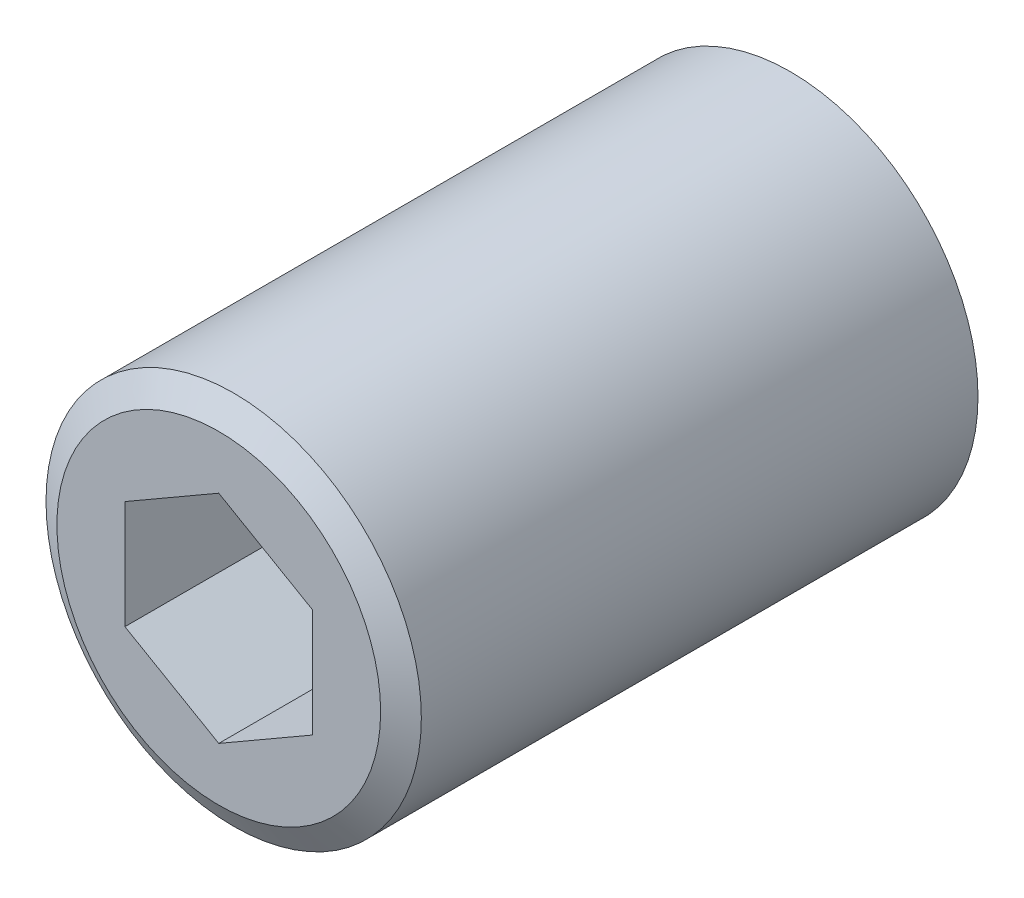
ISO-10303-21;
HEADER;
FILE_DESCRIPTION(('STEP AP214'),'2;1');
FILE_NAME('part.step','',(''),(''),'','','');
FILE_SCHEMA(('AUTOMOTIVE_DESIGN { 1 0 10303 214 1 1 1 1 }'));
ENDSEC;
DATA;
#1=APPLICATION_CONTEXT('core data for automotive mechanical design processes');
#2=APPLICATION_PROTOCOL_DEFINITION('international standard','automotive_design',2000,#1);
#3=PRODUCT_CONTEXT('',#1,'mechanical');
#4=PRODUCT('Part','Part','',(#3));
#5=PRODUCT_RELATED_PRODUCT_CATEGORY('part','',(#4));
#6=PRODUCT_DEFINITION_FORMATION('','',#4);
#7=PRODUCT_DEFINITION_CONTEXT('part definition',#1,'design');
#8=PRODUCT_DEFINITION('design','',#6,#7);
#9=PRODUCT_DEFINITION_SHAPE('','',#8);
#10=(LENGTH_UNIT() NAMED_UNIT(*) SI_UNIT(.MILLI.,.METRE.));
#11=(NAMED_UNIT(*) PLANE_ANGLE_UNIT() SI_UNIT($,.RADIAN.));
#12=(NAMED_UNIT(*) SI_UNIT($,.STERADIAN.) SOLID_ANGLE_UNIT());
#13=UNCERTAINTY_MEASURE_WITH_UNIT(LENGTH_MEASURE(1.E-05),#10,'distance_accuracy_value','');
#14=(GEOMETRIC_REPRESENTATION_CONTEXT(3) GLOBAL_UNCERTAINTY_ASSIGNED_CONTEXT((#13)) GLOBAL_UNIT_ASSIGNED_CONTEXT((#10,
#11,#12)) REPRESENTATION_CONTEXT('',''));
#15=CARTESIAN_POINT('',(0.,0.,0.));
#16=DIRECTION('',(0.,0.,1.));
#17=DIRECTION('',(1.,0.,0.));
#18=AXIS2_PLACEMENT_3D('',#15,#16,#17);
#19=CARTESIAN_POINT('',(8.,0.,1.27));
#20=DIRECTION('',(0.,0.,-1.));
#21=DIRECTION('',(-1.,0.,0.));
#22=AXIS2_PLACEMENT_3D('',#19,#20,#21);
#23=PLANE('',#22);
#24=CARTESIAN_POINT('',(0.,0.,1.27));
#25=DIRECTION('',(0.,0.,-1.));
#26=DIRECTION('',(-1.,0.,0.));
#27=AXIS2_PLACEMENT_3D('',#24,#25,#26);
#28=CIRCLE('',#27,6.9);
#29=CARTESIAN_POINT('',(-6.9,0.,1.27));
#30=VERTEX_POINT('',#29);
#31=EDGE_CURVE('E9',#30,#30,#28,.T.);
#32=ORIENTED_EDGE('',*,*,#31,.T.);
#33=EDGE_LOOP('',(#32));
#34=FACE_BOUND('',#33,.T.);
#35=CARTESIAN_POINT('',(0.,0.,1.27));
#36=DIRECTION('',(0.,0.,-1.));
#37=DIRECTION('',(-1.,0.,0.));
#38=AXIS2_PLACEMENT_3D('',#35,#36,#37);
#39=CIRCLE('',#38,5.55);
#40=CARTESIAN_POINT('',(-5.55,0.,1.27));
#41=VERTEX_POINT('',#40);
#42=EDGE_CURVE('E305',#41,#41,#39,.T.);
#43=ORIENTED_EDGE('',*,*,#42,.F.);
#44=EDGE_LOOP('',(#43));
#45=FACE_BOUND('',#44,.T.);
#46=ADVANCED_FACE('F15',(#34,#45),#23,.T.);
#47=CARTESIAN_POINT('',(0.,0.,46.27));
#48=DIRECTION('',(0.,0.,1.));
#49=DIRECTION('',(1.,0.,0.));
#50=AXIS2_PLACEMENT_3D('',#47,#48,#49);
#51=CYLINDRICAL_SURFACE('',#50,8.);
#52=CARTESIAN_POINT('',(0.,0.,25.6349147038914));
#53=DIRECTION('',(0.,0.,1.));
#54=DIRECTION('',(1.,0.,0.));
#55=AXIS2_PLACEMENT_3D('',#52,#53,#54);
#56=CIRCLE('',#55,8.);
#57=CARTESIAN_POINT('',(8.,0.,25.6349147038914));
#58=VERTEX_POINT('',#57);
#59=EDGE_CURVE('E24',#58,#58,#56,.F.);
#60=ORIENTED_EDGE('',*,*,#59,.T.);
#61=EDGE_LOOP('',(#60));
#62=FACE_BOUND('',#61,.T.);
#63=CARTESIAN_POINT('',(0.,0.,1.9050852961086));
#64=DIRECTION('',(0.,0.,-1.));
#65=DIRECTION('',(-1.,0.,0.));
#66=AXIS2_PLACEMENT_3D('',#63,#64,#65);
#67=CIRCLE('',#66,8.);
#68=CARTESIAN_POINT('',(-8.,0.,1.9050852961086));
#69=VERTEX_POINT('',#68);
#70=EDGE_CURVE('E240',#69,#69,#67,.F.);
#71=ORIENTED_EDGE('',*,*,#70,.T.);
#72=EDGE_LOOP('',(#71));
#73=FACE_BOUND('',#72,.T.);
#74=ADVANCED_FACE('F247',(#62,#73),#51,.T.);
#75=CARTESIAN_POINT('',(0.,0.,26.27));
#76=DIRECTION('',(0.,0.,1.));
#77=DIRECTION('',(1.,0.,0.));
#78=AXIS2_PLACEMENT_3D('',#75,#76,#77);
#79=PLANE('',#78);
#80=CARTESIAN_POINT('',(0.,0.,26.27));
#81=DIRECTION('',(0.,0.,1.));
#82=DIRECTION('',(1.,0.,0.));
#83=AXIS2_PLACEMENT_3D('',#80,#81,#82);
#84=CIRCLE('',#83,6.9);
#85=CARTESIAN_POINT('',(6.9,0.,26.27));
#86=VERTEX_POINT('',#85);
#87=EDGE_CURVE('E236',#86,#86,#84,.T.);
#88=ORIENTED_EDGE('',*,*,#87,.T.);
#89=EDGE_LOOP('',(#88));
#90=FACE_BOUND('',#89,.T.);
#91=DIRECTION('',(0.86602540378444,-0.5,0.));
#92=VECTOR('',#91,1.);
#93=CARTESIAN_POINT('',(-4.,-2.30940107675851,26.27));
#94=LINE('',#93,#92);
#95=CARTESIAN_POINT('',(-4.,-2.30940107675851,26.27));
#96=VERTEX_POINT('',#95);
#97=CARTESIAN_POINT('',(0.,-4.618802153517,26.27));
#98=VERTEX_POINT('',#97);
#99=EDGE_CURVE('E153',#96,#98,#94,.T.);
#100=ORIENTED_EDGE('',*,*,#99,.F.);
#101=DIRECTION('',(0.,-1.,0.));
#102=VECTOR('',#101,1.);
#103=CARTESIAN_POINT('',(-4.,2.30940107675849,26.27));
#104=LINE('',#103,#102);
#105=CARTESIAN_POINT('',(-4.,2.30940107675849,26.27));
#106=VERTEX_POINT('',#105);
#107=EDGE_CURVE('E173',#106,#96,#104,.T.);
#108=ORIENTED_EDGE('',*,*,#107,.F.);
#109=DIRECTION('',(0.866025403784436,0.5,0.));
#110=VECTOR('',#109,1.);
#111=CARTESIAN_POINT('',(-4.,2.30940107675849,26.27));
#112=LINE('',#111,#110);
#113=CARTESIAN_POINT('',(0.,4.61880215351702,26.27));
#114=VERTEX_POINT('',#113);
#115=EDGE_CURVE('E169',#106,#114,#112,.T.);
#116=ORIENTED_EDGE('',*,*,#115,.T.);
#117=DIRECTION('',(-0.866025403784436,0.5,0.));
#118=VECTOR('',#117,1.);
#119=CARTESIAN_POINT('',(4.,2.30940107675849,26.27));
#120=LINE('',#119,#118);
#121=CARTESIAN_POINT('',(4.,2.30940107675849,26.27));
#122=VERTEX_POINT('',#121);
#123=EDGE_CURVE('E165',#122,#114,#120,.T.);
#124=ORIENTED_EDGE('',*,*,#123,.F.);
#125=DIRECTION('',(0.,-1.,0.));
#126=VECTOR('',#125,1.);
#127=CARTESIAN_POINT('',(4.,2.30940107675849,26.27));
#128=LINE('',#127,#126);
#129=CARTESIAN_POINT('',(4.,-2.30940107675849,26.27));
#130=VERTEX_POINT('',#129);
#131=EDGE_CURVE('E161',#122,#130,#128,.T.);
#132=ORIENTED_EDGE('',*,*,#131,.T.);
#133=DIRECTION('',(-0.866025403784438,-0.5,0.));
#134=VECTOR('',#133,1.);
#135=CARTESIAN_POINT('',(4.,-2.30940107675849,26.27));
#136=LINE('',#135,#134);
#137=EDGE_CURVE('E156',#130,#98,#136,.T.);
#138=ORIENTED_EDGE('',*,*,#137,.T.);
#139=EDGE_LOOP('',(#100,#108,#116,#124,#132,#138));
#140=FACE_BOUND('',#139,.T.);
#141=ADVANCED_FACE('F255',(#90,#140),#79,.T.);
#142=CARTESIAN_POINT('',(-4.,-2.30940107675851,20.27));
#143=DIRECTION('',(-0.5,-0.86602540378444,0.));
#144=DIRECTION('',(-0.86602540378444,0.5,0.));
#145=AXIS2_PLACEMENT_3D('',#142,#143,#144);
#146=PLANE('',#145);
#147=DIRECTION('',(0.,0.,1.));
#148=VECTOR('',#147,1.);
#149=CARTESIAN_POINT('',(-4.,-2.30940107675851,20.27));
#150=LINE('',#149,#148);
#151=CARTESIAN_POINT('',(-4.,-2.30940107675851,20.27));
#152=VERTEX_POINT('',#151);
#153=EDGE_CURVE('E217',#152,#96,#150,.T.);
#154=ORIENTED_EDGE('',*,*,#153,.T.);
#155=ORIENTED_EDGE('',*,*,#99,.T.);
#156=DIRECTION('',(0.,0.,1.));
#157=VECTOR('',#156,1.);
#158=CARTESIAN_POINT('',(0.,-4.618802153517,20.27));
#159=LINE('',#158,#157);
#160=CARTESIAN_POINT('',(0.,-4.618802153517,20.27));
#161=VERTEX_POINT('',#160);
#162=EDGE_CURVE('E201',#161,#98,#159,.T.);
#163=ORIENTED_EDGE('',*,*,#162,.F.);
#164=DIRECTION('',(0.86602540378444,-0.5,0.));
#165=VECTOR('',#164,1.);
#166=CARTESIAN_POINT('',(-4.,-2.30940107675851,20.27));
#167=LINE('',#166,#165);
#168=EDGE_CURVE('E177',#152,#161,#167,.T.);
#169=ORIENTED_EDGE('',*,*,#168,.F.);
#170=EDGE_LOOP('',(#154,#155,#163,#169));
#171=FACE_BOUND('',#170,.T.);
#172=ADVANCED_FACE('F258',(#171),#146,.F.);
#173=CARTESIAN_POINT('',(-4.,2.30940107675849,20.27));
#174=DIRECTION('',(-1.,0.,0.));
#175=DIRECTION('',(0.,0.,1.));
#176=AXIS2_PLACEMENT_3D('',#173,#174,#175);
#177=PLANE('',#176);
#178=DIRECTION('',(0.,0.,1.));
#179=VECTOR('',#178,1.);
#180=CARTESIAN_POINT('',(-4.,2.30940107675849,20.27));
#181=LINE('',#180,#179);
#182=CARTESIAN_POINT('',(-4.,2.30940107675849,20.27));
#183=VERTEX_POINT('',#182);
#184=EDGE_CURVE('E214',#183,#106,#181,.T.);
#185=ORIENTED_EDGE('',*,*,#184,.T.);
#186=ORIENTED_EDGE('',*,*,#107,.T.);
#187=ORIENTED_EDGE('',*,*,#153,.F.);
#188=DIRECTION('',(0.,-1.,0.));
#189=VECTOR('',#188,1.);
#190=CARTESIAN_POINT('',(-4.,2.30940107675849,20.27));
#191=LINE('',#190,#189);
#192=EDGE_CURVE('E197',#183,#152,#191,.T.);
#193=ORIENTED_EDGE('',*,*,#192,.F.);
#194=EDGE_LOOP('',(#185,#186,#187,#193));
#195=FACE_BOUND('',#194,.T.);
#196=ADVANCED_FACE('F284',(#195),#177,.F.);
#197=CARTESIAN_POINT('',(-4.,2.30940107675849,20.27));
#198=DIRECTION('',(0.5,-0.866025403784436,0.));
#199=DIRECTION('',(-0.866025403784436,-0.5,0.));
#200=AXIS2_PLACEMENT_3D('',#197,#198,#199);
#201=PLANE('',#200);
#202=DIRECTION('',(0.,0.,1.));
#203=VECTOR('',#202,1.);
#204=CARTESIAN_POINT('',(0.,4.61880215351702,20.27));
#205=LINE('',#204,#203);
#206=CARTESIAN_POINT('',(0.,4.61880215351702,20.27));
#207=VERTEX_POINT('',#206);
#208=EDGE_CURVE('E211',#207,#114,#205,.T.);
#209=ORIENTED_EDGE('',*,*,#208,.T.);
#210=ORIENTED_EDGE('',*,*,#115,.F.);
#211=ORIENTED_EDGE('',*,*,#184,.F.);
#212=DIRECTION('',(0.866025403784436,0.5,0.));
#213=VECTOR('',#212,1.);
#214=CARTESIAN_POINT('',(-4.,2.30940107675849,20.27));
#215=LINE('',#214,#213);
#216=EDGE_CURVE('E193',#183,#207,#215,.T.);
#217=ORIENTED_EDGE('',*,*,#216,.T.);
#218=EDGE_LOOP('',(#209,#210,#211,#217));
#219=FACE_BOUND('',#218,.T.);
#220=ADVANCED_FACE('F281',(#219),#201,.T.);
#221=CARTESIAN_POINT('',(4.,2.30940107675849,20.27));
#222=DIRECTION('',(0.5,0.866025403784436,0.));
#223=DIRECTION('',(0.866025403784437,-0.5,0.));
#224=AXIS2_PLACEMENT_3D('',#221,#222,#223);
#225=PLANE('',#224);
#226=DIRECTION('',(0.,0.,1.));
#227=VECTOR('',#226,1.);
#228=CARTESIAN_POINT('',(4.,2.30940107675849,20.27));
#229=LINE('',#228,#227);
#230=CARTESIAN_POINT('',(4.,2.30940107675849,20.27));
#231=VERTEX_POINT('',#230);
#232=EDGE_CURVE('E208',#231,#122,#229,.T.);
#233=ORIENTED_EDGE('',*,*,#232,.T.);
#234=ORIENTED_EDGE('',*,*,#123,.T.);
#235=ORIENTED_EDGE('',*,*,#208,.F.);
#236=DIRECTION('',(-0.866025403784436,0.5,0.));
#237=VECTOR('',#236,1.);
#238=CARTESIAN_POINT('',(4.,2.30940107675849,20.27));
#239=LINE('',#238,#237);
#240=EDGE_CURVE('E189',#231,#207,#239,.T.);
#241=ORIENTED_EDGE('',*,*,#240,.F.);
#242=EDGE_LOOP('',(#233,#234,#235,#241));
#243=FACE_BOUND('',#242,.T.);
#244=ADVANCED_FACE('F277',(#243),#225,.F.);
#245=CARTESIAN_POINT('',(4.,2.30940107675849,20.27));
#246=DIRECTION('',(-1.,0.,0.));
#247=DIRECTION('',(0.,0.,1.));
#248=AXIS2_PLACEMENT_3D('',#245,#246,#247);
#249=PLANE('',#248);
#250=DIRECTION('',(0.,0.,1.));
#251=VECTOR('',#250,1.);
#252=CARTESIAN_POINT('',(4.,-2.30940107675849,20.27));
#253=LINE('',#252,#251);
#254=CARTESIAN_POINT('',(4.,-2.30940107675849,20.27));
#255=VERTEX_POINT('',#254);
#256=EDGE_CURVE('E205',#255,#130,#253,.T.);
#257=ORIENTED_EDGE('',*,*,#256,.T.);
#258=ORIENTED_EDGE('',*,*,#131,.F.);
#259=ORIENTED_EDGE('',*,*,#232,.F.);
#260=DIRECTION('',(0.,-1.,0.));
#261=VECTOR('',#260,1.);
#262=CARTESIAN_POINT('',(4.,2.30940107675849,20.27));
#263=LINE('',#262,#261);
#264=EDGE_CURVE('E185',#231,#255,#263,.T.);
#265=ORIENTED_EDGE('',*,*,#264,.T.);
#266=EDGE_LOOP('',(#257,#258,#259,#265));
#267=FACE_BOUND('',#266,.T.);
#268=ADVANCED_FACE('F273',(#267),#249,.T.);
#269=CARTESIAN_POINT('',(4.,-2.30940107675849,20.27));
#270=DIRECTION('',(-0.5,0.866025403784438,0.));
#271=DIRECTION('',(0.866025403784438,0.5,0.));
#272=AXIS2_PLACEMENT_3D('',#269,#270,#271);
#273=PLANE('',#272);
#274=DIRECTION('',(-0.866025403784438,-0.5,0.));
#275=VECTOR('',#274,1.);
#276=CARTESIAN_POINT('',(4.,-2.30940107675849,20.27));
#277=LINE('',#276,#275);
#278=EDGE_CURVE('E181',#255,#161,#277,.T.);
#279=ORIENTED_EDGE('',*,*,#278,.T.);
#280=ORIENTED_EDGE('',*,*,#162,.T.);
#281=ORIENTED_EDGE('',*,*,#137,.F.);
#282=ORIENTED_EDGE('',*,*,#256,.F.);
#283=EDGE_LOOP('',(#279,#280,#281,#282));
#284=FACE_BOUND('',#283,.T.);
#285=ADVANCED_FACE('F266',(#284),#273,.T.);
#286=CARTESIAN_POINT('',(-8.,0.,20.27));
#287=DIRECTION('',(0.,0.,1.));
#288=DIRECTION('',(1.,0.,0.));
#289=AXIS2_PLACEMENT_3D('',#286,#287,#288);
#290=PLANE('',#289);
#291=ORIENTED_EDGE('',*,*,#168,.T.);
#292=ORIENTED_EDGE('',*,*,#278,.F.);
#293=ORIENTED_EDGE('',*,*,#264,.F.);
#294=ORIENTED_EDGE('',*,*,#240,.T.);
#295=ORIENTED_EDGE('',*,*,#216,.F.);
#296=ORIENTED_EDGE('',*,*,#192,.T.);
#297=EDGE_LOOP('',(#291,#292,#293,#294,#295,#296));
#298=FACE_BOUND('',#297,.T.);
#299=ADVANCED_FACE('F270',(#298),#290,.T.);
#300=CARTESIAN_POINT('',(0.,0.,12.37));
#301=DIRECTION('',(0.,0.,-1.));
#302=DIRECTION('',(-1.,0.,0.));
#303=AXIS2_PLACEMENT_3D('',#300,#301,#302);
#304=CYLINDRICAL_SURFACE('',#303,5.55);
#305=ORIENTED_EDGE('',*,*,#42,.T.);
#306=EDGE_LOOP('',(#305));
#307=FACE_BOUND('',#306,.T.);
#308=CARTESIAN_POINT('',(0.,0.,1.5));
#309=DIRECTION('',(0.,0.,1.));
#310=DIRECTION('',(1.,0.,0.));
#311=AXIS2_PLACEMENT_3D('',#308,#309,#310);
#312=CIRCLE('',#311,5.55);
#313=CARTESIAN_POINT('',(5.55,0.,1.5));
#314=VERTEX_POINT('',#313);
#315=EDGE_CURVE('E134',#314,#314,#312,.T.);
#316=ORIENTED_EDGE('',*,*,#315,.T.);
#317=EDGE_LOOP('',(#316));
#318=FACE_BOUND('',#317,.T.);
#319=ADVANCED_FACE('F417',(#307,#318),#304,.F.);
#320=CARTESIAN_POINT('',(5.55,0.,1.5));
#321=DIRECTION('',(0.,-0.707106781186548,0.707106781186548));
#322=DIRECTION('',(0.,0.707106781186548,0.707106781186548));
#323=AXIS2_PLACEMENT_3D('',#320,#321,#322);
#324=PLANE('',#323);
#325=DIRECTION('',(-1.,0.,0.));
#326=VECTOR('',#325,1.);
#327=CARTESIAN_POINT('',(5.55,0.,1.5));
#328=LINE('',#327,#326);
#329=CARTESIAN_POINT('',(0.,0.,1.5));
#330=VERTEX_POINT('',#329);
#331=CARTESIAN_POINT('',(-3.,0.,1.5));
#332=VERTEX_POINT('',#331);
#333=EDGE_CURVE('E313',#330,#332,#328,.T.);
#334=ORIENTED_EDGE('',*,*,#333,.F.);
#335=DIRECTION('',(0.577350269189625,0.577350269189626,0.577350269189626));
#336=VECTOR('',#335,1.);
#337=CARTESIAN_POINT('',(-1.85,-1.85,-0.35));
#338=LINE('',#337,#336);
#339=CARTESIAN_POINT('',(-1.5,-1.5,0.));
#340=VERTEX_POINT('',#339);
#341=EDGE_CURVE('E341',#340,#330,#338,.T.);
#342=ORIENTED_EDGE('',*,*,#341,.F.);
#343=DIRECTION('',(0.577350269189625,-0.577350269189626,-0.577350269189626));
#344=VECTOR('',#343,1.);
#345=CARTESIAN_POINT('',(-0.150000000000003,-2.85,-1.35));
#346=LINE('',#345,#344);
#347=EDGE_CURVE('E345',#332,#340,#346,.T.);
#348=ORIENTED_EDGE('',*,*,#347,.F.);
#349=EDGE_LOOP('',(#334,#342,#348));
#350=FACE_BOUND('',#349,.T.);
#351=ADVANCED_FACE('F383',(#350),#324,.F.);
#352=CARTESIAN_POINT('',(5.55,1.49999999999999,0.));
#353=DIRECTION('',(0.,0.707106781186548,0.707106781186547));
#354=DIRECTION('',(0.,0.707106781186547,-0.707106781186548));
#355=AXIS2_PLACEMENT_3D('',#352,#353,#354);
#356=PLANE('',#355);
#357=DIRECTION('',(-0.577350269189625,0.577350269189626,-0.577350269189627));
#358=VECTOR('',#357,1.);
#359=CARTESIAN_POINT('',(1.85,-1.85,3.35));
#360=LINE('',#359,#358);
#361=CARTESIAN_POINT('',(-1.5,1.49999999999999,0.));
#362=VERTEX_POINT('',#361);
#363=EDGE_CURVE('E352',#330,#362,#360,.T.);
#364=ORIENTED_EDGE('',*,*,#363,.F.);
#365=ORIENTED_EDGE('',*,*,#333,.T.);
#366=DIRECTION('',(-0.577350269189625,-0.577350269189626,0.577350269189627));
#367=VECTOR('',#366,1.);
#368=CARTESIAN_POINT('',(-3.85,-0.850000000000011,2.35));
#369=LINE('',#368,#367);
#370=EDGE_CURVE('E137',#362,#332,#369,.T.);
#371=ORIENTED_EDGE('',*,*,#370,.F.);
#372=EDGE_LOOP('',(#364,#365,#371));
#373=FACE_BOUND('',#372,.T.);
#374=ADVANCED_FACE('F381',(#373),#356,.F.);
#375=CARTESIAN_POINT('',(0.,-5.55,1.5));
#376=DIRECTION('',(-0.707106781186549,0.,0.707106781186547));
#377=DIRECTION('',(0.707106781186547,0.,0.707106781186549));
#378=AXIS2_PLACEMENT_3D('',#375,#376,#377);
#379=PLANE('',#378);
#380=DIRECTION('',(0.,1.,0.));
#381=VECTOR('',#380,1.);
#382=CARTESIAN_POINT('',(0.,-5.55,1.5));
#383=LINE('',#382,#381);
#384=CARTESIAN_POINT('',(0.,3.,1.5));
#385=VERTEX_POINT('',#384);
#386=EDGE_CURVE('E145',#330,#385,#383,.T.);
#387=ORIENTED_EDGE('',*,*,#386,.F.);
#388=ORIENTED_EDGE('',*,*,#363,.T.);
#389=DIRECTION('',(0.577350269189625,0.577350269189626,0.577350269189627));
#390=VECTOR('',#389,1.);
#391=CARTESIAN_POINT('',(-2.85,0.15,-1.35));
#392=LINE('',#391,#390);
#393=EDGE_CURVE('E115',#362,#385,#392,.T.);
#394=ORIENTED_EDGE('',*,*,#393,.T.);
#395=EDGE_LOOP('',(#387,#388,#394));
#396=FACE_BOUND('',#395,.T.);
#397=ADVANCED_FACE('F377',(#396),#379,.F.);
#398=CARTESIAN_POINT('',(1.5,-5.55,0.));
#399=DIRECTION('',(0.707106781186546,0.,0.707106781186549));
#400=DIRECTION('',(0.707106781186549,0.,-0.707106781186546));
#401=AXIS2_PLACEMENT_3D('',#398,#399,#400);
#402=PLANE('',#401);
#403=DIRECTION('',(0.577350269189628,-0.577350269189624,-0.577350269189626));
#404=VECTOR('',#403,1.);
#405=CARTESIAN_POINT('',(3.85,-0.849999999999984,-2.35));
#406=LINE('',#405,#404);
#407=CARTESIAN_POINT('',(1.49999999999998,1.49999999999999,0.));
#408=VERTEX_POINT('',#407);
#409=EDGE_CURVE('E321',#385,#408,#406,.T.);
#410=ORIENTED_EDGE('',*,*,#409,.T.);
#411=DIRECTION('',(-0.577350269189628,-0.577350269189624,0.577350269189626));
#412=VECTOR('',#411,1.);
#413=CARTESIAN_POINT('',(-0.849999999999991,-0.85,2.35));
#414=LINE('',#413,#412);
#415=EDGE_CURVE('E348',#408,#330,#414,.T.);
#416=ORIENTED_EDGE('',*,*,#415,.T.);
#417=ORIENTED_EDGE('',*,*,#386,.T.);
#418=EDGE_LOOP('',(#410,#416,#417));
#419=FACE_BOUND('',#418,.T.);
#420=ADVANCED_FACE('F375',(#419),#402,.F.);
#421=DIRECTION('',(-0.577350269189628,0.577350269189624,-0.577350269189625));
#422=VECTOR('',#421,1.);
#423=CARTESIAN_POINT('',(3.85,-0.85,2.35));
#424=LINE('',#423,#422);
#425=CARTESIAN_POINT('',(3.,0.,1.5));
#426=VERTEX_POINT('',#425);
#427=EDGE_CURVE('E224',#426,#408,#424,.T.);
#428=ORIENTED_EDGE('',*,*,#427,.F.);
#429=EDGE_CURVE('E31',#426,#330,#328,.T.);
#430=ORIENTED_EDGE('',*,*,#429,.T.);
#431=ORIENTED_EDGE('',*,*,#415,.F.);
#432=EDGE_LOOP('',(#428,#430,#431));
#433=FACE_BOUND('',#432,.T.);
#434=ADVANCED_FACE('F405',(#433),#356,.F.);
#435=ORIENTED_EDGE('',*,*,#429,.F.);
#436=DIRECTION('',(0.577350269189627,0.577350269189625,0.577350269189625));
#437=VECTOR('',#436,1.);
#438=CARTESIAN_POINT('',(0.149999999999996,-2.85,-1.35));
#439=LINE('',#438,#437);
#440=CARTESIAN_POINT('',(1.5,-1.5,0.));
#441=VERTEX_POINT('',#440);
#442=EDGE_CURVE('E228',#441,#426,#439,.T.);
#443=ORIENTED_EDGE('',*,*,#442,.F.);
#444=DIRECTION('',(0.577350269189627,-0.577350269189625,-0.577350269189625));
#445=VECTOR('',#444,1.);
#446=CARTESIAN_POINT('',(2.85,-2.85,-1.35));
#447=LINE('',#446,#445);
#448=EDGE_CURVE('E337',#330,#441,#447,.T.);
#449=ORIENTED_EDGE('',*,*,#448,.F.);
#450=EDGE_LOOP('',(#435,#443,#449));
#451=FACE_BOUND('',#450,.T.);
#452=ADVANCED_FACE('F452',(#451),#324,.F.);
#453=ORIENTED_EDGE('',*,*,#448,.T.);
#454=DIRECTION('',(-0.577350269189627,-0.577350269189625,0.577350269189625));
#455=VECTOR('',#454,1.);
#456=CARTESIAN_POINT('',(0.15,-2.85,1.35));
#457=LINE('',#456,#455);
#458=CARTESIAN_POINT('',(0.,-3.00000000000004,1.5));
#459=VERTEX_POINT('',#458);
#460=EDGE_CURVE('E39',#441,#459,#457,.T.);
#461=ORIENTED_EDGE('',*,*,#460,.T.);
#462=EDGE_CURVE('E157',#459,#330,#383,.T.);
#463=ORIENTED_EDGE('',*,*,#462,.T.);
#464=EDGE_LOOP('',(#453,#461,#463));
#465=FACE_BOUND('',#464,.T.);
#466=ADVANCED_FACE('F366',(#465),#402,.F.);
#467=ORIENTED_EDGE('',*,*,#462,.F.);
#468=DIRECTION('',(-0.577350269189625,0.577350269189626,-0.577350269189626));
#469=VECTOR('',#468,1.);
#470=CARTESIAN_POINT('',(0.85,-3.85,2.35));
#471=LINE('',#470,#469);
#472=EDGE_CURVE('E329',#459,#340,#471,.T.);
#473=ORIENTED_EDGE('',*,*,#472,.T.);
#474=ORIENTED_EDGE('',*,*,#341,.T.);
#475=EDGE_LOOP('',(#467,#473,#474));
#476=FACE_BOUND('',#475,.T.);
#477=ADVANCED_FACE('F368',(#476),#379,.F.);
#478=CARTESIAN_POINT('',(-1.5,-5.55,0.));
#479=DIRECTION('',(0.707106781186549,0.,0.707106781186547));
#480=DIRECTION('',(0.707106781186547,0.,-0.707106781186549));
#481=AXIS2_PLACEMENT_3D('',#478,#479,#480);
#482=PLANE('',#481);
#483=ORIENTED_EDGE('',*,*,#347,.T.);
#484=DIRECTION('',(-0.577350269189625,-0.577350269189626,0.577350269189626));
#485=VECTOR('',#484,1.);
#486=CARTESIAN_POINT('',(-2.85,-2.85,1.35));
#487=LINE('',#486,#485);
#488=CARTESIAN_POINT('',(-3.,-3.00000000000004,1.5));
#489=VERTEX_POINT('',#488);
#490=EDGE_CURVE('E333',#340,#489,#487,.T.);
#491=ORIENTED_EDGE('',*,*,#490,.T.);
#492=DIRECTION('',(0.,1.,0.));
#493=VECTOR('',#492,1.);
#494=CARTESIAN_POINT('',(-3.,-5.55,1.5));
#495=LINE('',#494,#493);
#496=EDGE_CURVE('E139',#489,#332,#495,.T.);
#497=ORIENTED_EDGE('',*,*,#496,.T.);
#498=EDGE_LOOP('',(#483,#491,#497));
#499=FACE_BOUND('',#498,.T.);
#500=ADVANCED_FACE('F386',(#499),#482,.F.);
#501=DIRECTION('',(0.577350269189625,-0.577350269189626,-0.577350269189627));
#502=VECTOR('',#501,1.);
#503=CARTESIAN_POINT('',(0.85,-0.85,-2.35));
#504=LINE('',#503,#502);
#505=CARTESIAN_POINT('',(-3.,2.99999999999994,1.5));
#506=VERTEX_POINT('',#505);
#507=EDGE_CURVE('E109',#506,#362,#504,.T.);
#508=ORIENTED_EDGE('',*,*,#507,.T.);
#509=ORIENTED_EDGE('',*,*,#370,.T.);
#510=EDGE_CURVE('E129',#332,#506,#495,.T.);
#511=ORIENTED_EDGE('',*,*,#510,.T.);
#512=EDGE_LOOP('',(#508,#509,#511));
#513=FACE_BOUND('',#512,.T.);
#514=ADVANCED_FACE('F136',(#513),#482,.F.);
#515=CARTESIAN_POINT('',(5.55,1.49999999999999,0.));
#516=DIRECTION('',(0.,-0.707106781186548,0.707106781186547));
#517=DIRECTION('',(0.,0.707106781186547,0.707106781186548));
#518=AXIS2_PLACEMENT_3D('',#515,#516,#517);
#519=PLANE('',#518);
#520=DIRECTION('',(-1.,0.,0.));
#521=VECTOR('',#520,1.);
#522=CARTESIAN_POINT('',(5.55,2.99999999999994,1.5));
#523=LINE('',#522,#521);
#524=EDGE_CURVE('E112',#385,#506,#523,.T.);
#525=ORIENTED_EDGE('',*,*,#524,.F.);
#526=ORIENTED_EDGE('',*,*,#393,.F.);
#527=ORIENTED_EDGE('',*,*,#507,.F.);
#528=EDGE_LOOP('',(#525,#526,#527));
#529=FACE_BOUND('',#528,.T.);
#530=ADVANCED_FACE('F111',(#529),#519,.F.);
#531=CARTESIAN_POINT('',(3.,3.,1.5));
#532=VERTEX_POINT('',#531);
#533=EDGE_CURVE('E132',#532,#385,#523,.T.);
#534=ORIENTED_EDGE('',*,*,#533,.F.);
#535=DIRECTION('',(0.577350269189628,0.577350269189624,0.577350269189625));
#536=VECTOR('',#535,1.);
#537=CARTESIAN_POINT('',(-0.85,-0.849999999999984,-2.35));
#538=LINE('',#537,#536);
#539=EDGE_CURVE('E220',#408,#532,#538,.T.);
#540=ORIENTED_EDGE('',*,*,#539,.F.);
#541=ORIENTED_EDGE('',*,*,#409,.F.);
#542=EDGE_LOOP('',(#534,#540,#541));
#543=FACE_BOUND('',#542,.T.);
#544=ADVANCED_FACE('F402',(#543),#519,.F.);
#545=CARTESIAN_POINT('',(1.5,-5.55,0.));
#546=DIRECTION('',(-0.707106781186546,0.,0.707106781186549));
#547=DIRECTION('',(0.707106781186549,0.,0.707106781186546));
#548=AXIS2_PLACEMENT_3D('',#545,#546,#547);
#549=PLANE('',#548);
#550=DIRECTION('',(0.,1.,0.));
#551=VECTOR('',#550,1.);
#552=CARTESIAN_POINT('',(3.,-5.55,1.5));
#553=LINE('',#552,#551);
#554=EDGE_CURVE('E147',#426,#532,#553,.T.);
#555=ORIENTED_EDGE('',*,*,#554,.F.);
#556=ORIENTED_EDGE('',*,*,#427,.T.);
#557=ORIENTED_EDGE('',*,*,#539,.T.);
#558=EDGE_LOOP('',(#555,#556,#557));
#559=FACE_BOUND('',#558,.T.);
#560=ADVANCED_FACE('F410',(#559),#549,.F.);
#561=CARTESIAN_POINT('',(3.,-3.00000000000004,1.5));
#562=VERTEX_POINT('',#561);
#563=EDGE_CURVE('E140',#562,#426,#553,.T.);
#564=ORIENTED_EDGE('',*,*,#563,.F.);
#565=DIRECTION('',(-0.577350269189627,0.577350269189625,-0.577350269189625));
#566=VECTOR('',#565,1.);
#567=CARTESIAN_POINT('',(2.85,-2.85,1.35));
#568=LINE('',#567,#566);
#569=EDGE_CURVE('E232',#562,#441,#568,.T.);
#570=ORIENTED_EDGE('',*,*,#569,.T.);
#571=ORIENTED_EDGE('',*,*,#442,.T.);
#572=EDGE_LOOP('',(#564,#570,#571));
#573=FACE_BOUND('',#572,.T.);
#574=ADVANCED_FACE('F396',(#573),#549,.F.);
#575=CARTESIAN_POINT('',(5.55,-1.5,0.));
#576=DIRECTION('',(0.,0.707106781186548,0.707106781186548));
#577=DIRECTION('',(0.,0.707106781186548,-0.707106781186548));
#578=AXIS2_PLACEMENT_3D('',#575,#576,#577);
#579=PLANE('',#578);
#580=ORIENTED_EDGE('',*,*,#569,.F.);
#581=DIRECTION('',(-1.,0.,0.));
#582=VECTOR('',#581,1.);
#583=CARTESIAN_POINT('',(5.55,-3.00000000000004,1.5));
#584=LINE('',#583,#582);
#585=EDGE_CURVE('E317',#562,#459,#584,.T.);
#586=ORIENTED_EDGE('',*,*,#585,.T.);
#587=ORIENTED_EDGE('',*,*,#460,.F.);
#588=EDGE_LOOP('',(#580,#586,#587));
#589=FACE_BOUND('',#588,.T.);
#590=ADVANCED_FACE('F361',(#589),#579,.F.);
#591=ORIENTED_EDGE('',*,*,#472,.F.);
#592=EDGE_CURVE('E318',#459,#489,#584,.T.);
#593=ORIENTED_EDGE('',*,*,#592,.T.);
#594=ORIENTED_EDGE('',*,*,#490,.F.);
#595=EDGE_LOOP('',(#591,#593,#594));
#596=FACE_BOUND('',#595,.T.);
#597=ADVANCED_FACE('F388',(#596),#579,.F.);
#598=CARTESIAN_POINT('',(-3.,-5.55,1.5));
#599=DIRECTION('',(0.,0.,1.));
#600=DIRECTION('',(1.,0.,0.));
#601=AXIS2_PLACEMENT_3D('',#598,#599,#600);
#602=PLANE('',#601);
#603=ORIENTED_EDGE('',*,*,#592,.F.);
#604=ORIENTED_EDGE('',*,*,#585,.F.);
#605=ORIENTED_EDGE('',*,*,#563,.T.);
#606=ORIENTED_EDGE('',*,*,#554,.T.);
#607=ORIENTED_EDGE('',*,*,#533,.T.);
#608=ORIENTED_EDGE('',*,*,#524,.T.);
#609=ORIENTED_EDGE('',*,*,#510,.F.);
#610=ORIENTED_EDGE('',*,*,#496,.F.);
#611=EDGE_LOOP('',(#603,#604,#605,#606,#607,#608,#609,#610));
#612=FACE_BOUND('',#611,.T.);
#613=ORIENTED_EDGE('',*,*,#315,.F.);
#614=EDGE_LOOP('',(#613));
#615=FACE_BOUND('',#614,.T.);
#616=ADVANCED_FACE('F126',(#612,#615),#602,.F.);
#617=CARTESIAN_POINT('',(0.,0.,26.27));
#618=DIRECTION('',(0.,0.,-1.));
#619=DIRECTION('',(-1.,0.,0.));
#620=AXIS2_PLACEMENT_3D('',#617,#618,#619);
#621=CONICAL_SURFACE('',#620,6.9,1.0471975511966);
#622=ORIENTED_EDGE('',*,*,#59,.F.);
#623=EDGE_LOOP('',(#622));
#624=FACE_BOUND('',#623,.T.);
#625=ORIENTED_EDGE('',*,*,#87,.F.);
#626=EDGE_LOOP('',(#625));
#627=FACE_BOUND('',#626,.T.);
#628=ADVANCED_FACE('F250',(#624,#627),#621,.T.);
#629=CARTESIAN_POINT('',(0.,0.,1.9050852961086));
#630=DIRECTION('',(0.,0.,1.));
#631=DIRECTION('',(1.,0.,0.));
#632=AXIS2_PLACEMENT_3D('',#629,#630,#631);
#633=CONICAL_SURFACE('',#632,8.,1.0471975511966);
#634=ORIENTED_EDGE('',*,*,#31,.F.);
#635=EDGE_LOOP('',(#634));
#636=FACE_BOUND('',#635,.T.);
#637=ORIENTED_EDGE('',*,*,#70,.F.);
#638=EDGE_LOOP('',(#637));
#639=FACE_BOUND('',#638,.T.);
#640=ADVANCED_FACE('F17',(#636,#639),#633,.T.);
#641=CLOSED_SHELL('',(#46,#74,#141,#172,#196,#220,#244,#268,#285,#299,#319,#351,#374,#397,#420,
#434,#452,#466,#477,#500,#514,#530,#544,#560,#574,#590,#597,#616,#628,#640));
#642=MANIFOLD_SOLID_BREP('B1',#641);
#643=ADVANCED_BREP_SHAPE_REPRESENTATION('',(#18,#642),#14);
#644=SHAPE_DEFINITION_REPRESENTATION(#9,#643);
ENDSEC;
END-ISO-10303-21;
